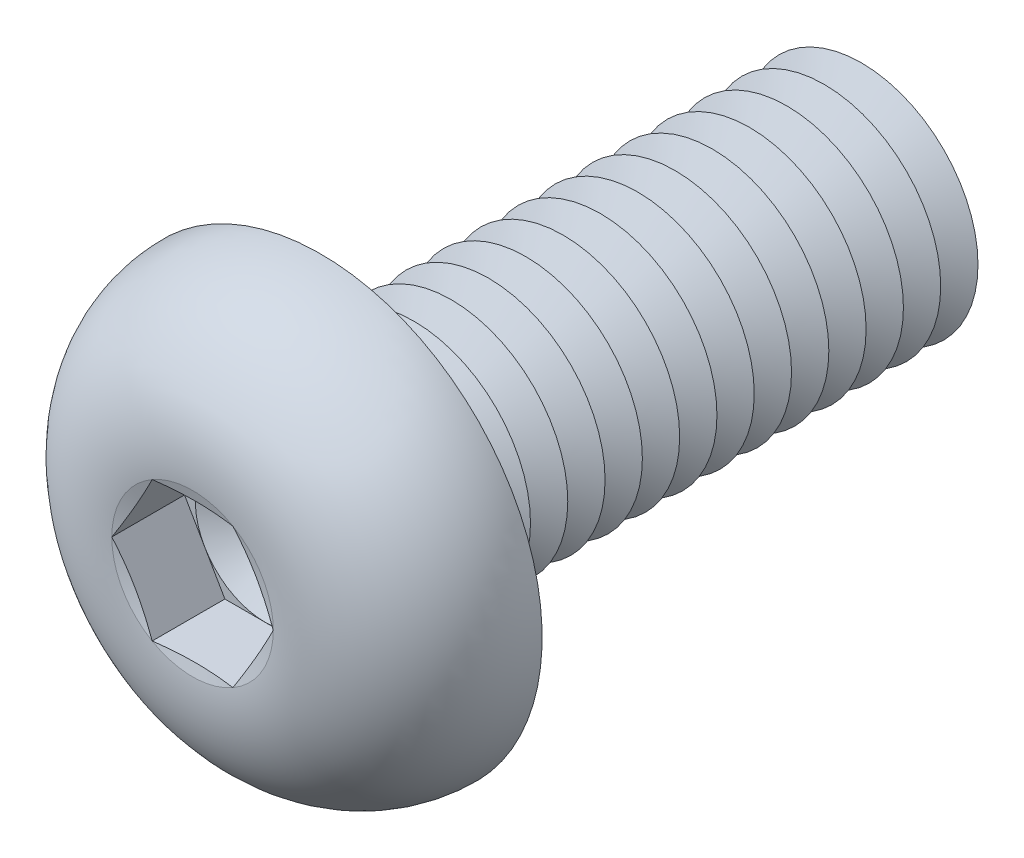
ISO-10303-21;
HEADER;
FILE_DESCRIPTION(('STEP AP214'),'2;1');
FILE_NAME('part.step','',(''),(''),'','','');
FILE_SCHEMA(('AUTOMOTIVE_DESIGN { 1 0 10303 214 1 1 1 1 }'));
ENDSEC;
DATA;
#1=APPLICATION_CONTEXT('core data for automotive mechanical design processes');
#2=APPLICATION_PROTOCOL_DEFINITION('international standard','automotive_design',2000,#1);
#3=PRODUCT_CONTEXT('',#1,'mechanical');
#4=PRODUCT('Part','Part','',(#3));
#5=PRODUCT_RELATED_PRODUCT_CATEGORY('part','',(#4));
#6=PRODUCT_DEFINITION_FORMATION('','',#4);
#7=PRODUCT_DEFINITION_CONTEXT('part definition',#1,'design');
#8=PRODUCT_DEFINITION('design','',#6,#7);
#9=PRODUCT_DEFINITION_SHAPE('','',#8);
#10=(LENGTH_UNIT() NAMED_UNIT(*) SI_UNIT(.MILLI.,.METRE.));
#11=(NAMED_UNIT(*) PLANE_ANGLE_UNIT() SI_UNIT($,.RADIAN.));
#12=(NAMED_UNIT(*) SI_UNIT($,.STERADIAN.) SOLID_ANGLE_UNIT());
#13=UNCERTAINTY_MEASURE_WITH_UNIT(LENGTH_MEASURE(1.E-05),#10,'distance_accuracy_value','');
#14=(GEOMETRIC_REPRESENTATION_CONTEXT(3) GLOBAL_UNCERTAINTY_ASSIGNED_CONTEXT((#13)) GLOBAL_UNIT_ASSIGNED_CONTEXT((#10,
#11,#12)) REPRESENTATION_CONTEXT('',''));
#15=CARTESIAN_POINT('',(0.,0.,0.));
#16=DIRECTION('',(0.,0.,1.));
#17=DIRECTION('',(1.,0.,0.));
#18=AXIS2_PLACEMENT_3D('',#15,#16,#17);
#19=CARTESIAN_POINT('',(0.,0.,1.19));
#20=DIRECTION('',(0.,0.,1.));
#21=DIRECTION('',(1.,0.,0.));
#22=AXIS2_PLACEMENT_3D('',#19,#20,#21);
#23=PLANE('',#22);
#24=CARTESIAN_POINT('',(0.,0.,1.19));
#25=DIRECTION('',(0.,0.,1.));
#26=DIRECTION('',(1.,0.,0.));
#27=AXIS2_PLACEMENT_3D('',#24,#25,#26);
#28=CIRCLE('',#27,1.49999930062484);
#29=CARTESIAN_POINT('',(1.2990375,0.749999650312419,1.19));
#30=VERTEX_POINT('',#29);
#31=CARTESIAN_POINT('',(0.,1.49999930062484,1.19));
#32=VERTEX_POINT('',#31);
#33=EDGE_CURVE('E118',#30,#32,#28,.T.);
#34=ORIENTED_EDGE('',*,*,#33,.F.);
#35=DIRECTION('',(-0.5,0.866025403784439,0.));
#36=VECTOR('',#35,1.);
#37=CARTESIAN_POINT('',(1.73205,0.,1.19));
#38=LINE('',#37,#36);
#39=CARTESIAN_POINT('',(0.866025,1.49999930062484,1.19));
#40=VERTEX_POINT('',#39);
#41=EDGE_CURVE('E125',#30,#40,#38,.T.);
#42=ORIENTED_EDGE('',*,*,#41,.T.);
#43=DIRECTION('',(-1.,0.,0.));
#44=VECTOR('',#43,1.);
#45=CARTESIAN_POINT('',(0.866025,1.49999930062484,1.19));
#46=LINE('',#45,#44);
#47=EDGE_CURVE('E136',#40,#32,#46,.T.);
#48=ORIENTED_EDGE('',*,*,#47,.T.);
#49=EDGE_LOOP('',(#34,#42,#48));
#50=FACE_BOUND('',#49,.T.);
#51=ADVANCED_FACE('F39',(#50),#23,.T.);
#52=CARTESIAN_POINT('',(0.,0.,1.19));
#53=DIRECTION('',(0.,0.,1.));
#54=DIRECTION('',(1.,0.,0.));
#55=AXIS2_PLACEMENT_3D('',#52,#53,#54);
#56=CIRCLE('',#55,1.49999930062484);
#57=CARTESIAN_POINT('',(-1.2990375,0.749999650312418,1.19));
#58=VERTEX_POINT('',#57);
#59=EDGE_CURVE('E11',#32,#58,#56,.T.);
#60=ORIENTED_EDGE('',*,*,#59,.F.);
#61=CARTESIAN_POINT('',(-0.866025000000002,1.49999930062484,1.19));
#62=VERTEX_POINT('',#61);
#63=EDGE_CURVE('E131',#32,#62,#46,.T.);
#64=ORIENTED_EDGE('',*,*,#63,.T.);
#65=DIRECTION('',(-0.5,-0.866025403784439,0.));
#66=VECTOR('',#65,1.);
#67=CARTESIAN_POINT('',(-0.866025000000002,1.49999930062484,1.19));
#68=LINE('',#67,#66);
#69=EDGE_CURVE('E134',#62,#58,#68,.T.);
#70=ORIENTED_EDGE('',*,*,#69,.T.);
#71=EDGE_LOOP('',(#60,#64,#70));
#72=FACE_BOUND('',#71,.T.);
#73=ADVANCED_FACE('F130',(#72),#23,.T.);
#74=CARTESIAN_POINT('',(-1.2990375,-0.749999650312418,1.19));
#75=VERTEX_POINT('',#74);
#76=EDGE_CURVE('E49',#58,#75,#56,.T.);
#77=ORIENTED_EDGE('',*,*,#76,.F.);
#78=CARTESIAN_POINT('',(-1.73205,0.,1.19));
#79=VERTEX_POINT('',#78);
#80=EDGE_CURVE('E143',#58,#79,#68,.T.);
#81=ORIENTED_EDGE('',*,*,#80,.T.);
#82=DIRECTION('',(0.5,-0.866025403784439,0.));
#83=VECTOR('',#82,1.);
#84=CARTESIAN_POINT('',(-1.73205,0.,1.19));
#85=LINE('',#84,#83);
#86=EDGE_CURVE('E152',#79,#75,#85,.T.);
#87=ORIENTED_EDGE('',*,*,#86,.T.);
#88=EDGE_LOOP('',(#77,#81,#87));
#89=FACE_BOUND('',#88,.T.);
#90=ADVANCED_FACE('F388',(#89),#23,.T.);
#91=CARTESIAN_POINT('',(0.,-1.49999930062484,1.19));
#92=VERTEX_POINT('',#91);
#93=EDGE_CURVE('E372',#75,#92,#56,.T.);
#94=ORIENTED_EDGE('',*,*,#93,.F.);
#95=CARTESIAN_POINT('',(-0.866025,-1.49999930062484,1.19));
#96=VERTEX_POINT('',#95);
#97=EDGE_CURVE('E151',#75,#96,#85,.T.);
#98=ORIENTED_EDGE('',*,*,#97,.T.);
#99=DIRECTION('',(1.,0.,0.));
#100=VECTOR('',#99,1.);
#101=CARTESIAN_POINT('',(-0.866025,-1.49999930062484,1.19));
#102=LINE('',#101,#100);
#103=EDGE_CURVE('E157',#96,#92,#102,.T.);
#104=ORIENTED_EDGE('',*,*,#103,.T.);
#105=EDGE_LOOP('',(#94,#98,#104));
#106=FACE_BOUND('',#105,.T.);
#107=ADVANCED_FACE('F381',(#106),#23,.T.);
#108=CARTESIAN_POINT('',(1.2990375,-0.749999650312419,1.19));
#109=VERTEX_POINT('',#108);
#110=EDGE_CURVE('E56',#92,#109,#56,.T.);
#111=ORIENTED_EDGE('',*,*,#110,.F.);
#112=CARTESIAN_POINT('',(0.866025,-1.49999930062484,1.19));
#113=VERTEX_POINT('',#112);
#114=EDGE_CURVE('E156',#92,#113,#102,.T.);
#115=ORIENTED_EDGE('',*,*,#114,.T.);
#116=DIRECTION('',(0.5,0.866025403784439,0.));
#117=VECTOR('',#116,1.);
#118=CARTESIAN_POINT('',(0.866025,-1.49999930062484,1.19));
#119=LINE('',#118,#117);
#120=EDGE_CURVE('E162',#113,#109,#119,.T.);
#121=ORIENTED_EDGE('',*,*,#120,.T.);
#122=EDGE_LOOP('',(#111,#115,#121));
#123=FACE_BOUND('',#122,.T.);
#124=ADVANCED_FACE('F428',(#123),#23,.T.);
#125=CARTESIAN_POINT('',(0.,0.,2.75));
#126=DIRECTION('',(0.,0.,1.));
#127=DIRECTION('',(1.,0.,0.));
#128=AXIS2_PLACEMENT_3D('',#125,#126,#127);
#129=CONICAL_SURFACE('',#128,1.73205,1.30899693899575);
#130=CARTESIAN_POINT('',(1.73216547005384,-0.000200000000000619,2.75003094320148));
#131=CARTESIAN_POINT('',(1.69619207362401,0.0621077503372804,2.74038633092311));
#132=CARTESIAN_POINT('',(1.66015343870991,0.124528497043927,2.73163050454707));
#133=CARTESIAN_POINT('',(1.58794885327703,0.249590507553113,2.71624720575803));
#134=CARTESIAN_POINT('',(1.5517828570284,0.312231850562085,2.70962059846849));
#135=CARTESIAN_POINT('',(1.47954289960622,0.437355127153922,2.69888271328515));
#136=CARTESIAN_POINT('',(1.4434694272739,0.499836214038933,2.69475862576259));
#137=CARTESIAN_POINT('',(1.37127646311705,0.624878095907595,2.68922863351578));
#138=CARTESIAN_POINT('',(1.33515698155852,0.687438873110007,2.68782220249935));
#139=CARTESIAN_POINT('',(1.26291801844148,0.812560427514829,2.68782220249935));
#140=CARTESIAN_POINT('',(1.22679853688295,0.87512120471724,2.68922863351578));
#141=CARTESIAN_POINT('',(1.1546055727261,1.0001630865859,2.69475862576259));
#142=CARTESIAN_POINT('',(1.11853210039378,1.06264417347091,2.69888271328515));
#143=CARTESIAN_POINT('',(1.0462921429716,1.18776745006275,2.70962059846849));
#144=CARTESIAN_POINT('',(1.01012614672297,1.25040879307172,2.71624720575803));
#145=CARTESIAN_POINT('',(0.937921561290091,1.37547080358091,2.73163050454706));
#146=CARTESIAN_POINT('',(0.901882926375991,1.43789155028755,2.74038633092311));
#147=CARTESIAN_POINT('',(0.865909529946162,1.50019930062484,2.75003094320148));
#148=B_SPLINE_CURVE_WITH_KNOTS('',3,(#130,#131,#132,#133,#134,#135,#136,#137,#138,#139,#140,
#141,#142,#143,#144,#145,#146,#147),.UNSPECIFIED.,.F.,.F.,(4,2,2,2,2,2,2,2,4),(0.,
0.217782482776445,0.435653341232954,0.652399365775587,0.869103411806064,1.08580745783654,
1.30255348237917,1.52042434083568,1.73820682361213),.UNSPECIFIED.);
#149=CARTESIAN_POINT('',(1.73205,0.,2.75));
#150=VERTEX_POINT('',#149);
#151=CARTESIAN_POINT('',(0.866025,1.49999930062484,2.75));
#152=VERTEX_POINT('',#151);
#153=EDGE_CURVE('E221',#150,#152,#148,.T.);
#154=ORIENTED_EDGE('',*,*,#153,.F.);
#155=CARTESIAN_POINT('',(0.,0.,2.75));
#156=DIRECTION('',(0.,0.,-1.));
#157=DIRECTION('',(-1.,0.,0.));
#158=AXIS2_PLACEMENT_3D('',#155,#156,#157);
#159=CIRCLE('',#158,1.73205);
#160=EDGE_CURVE('E418',#152,#150,#159,.T.);
#161=ORIENTED_EDGE('',*,*,#160,.F.);
#162=EDGE_LOOP('',(#154,#161));
#163=FACE_BOUND('',#162,.T.);
#164=ADVANCED_FACE('F445',(#163),#129,.F.);
#165=CARTESIAN_POINT('',(0.865909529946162,-1.50019930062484,2.75003094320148));
#166=CARTESIAN_POINT('',(0.901882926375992,-1.43789155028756,2.74038633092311));
#167=CARTESIAN_POINT('',(0.937921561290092,-1.37547080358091,2.73163050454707));
#168=CARTESIAN_POINT('',(1.01012614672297,-1.25040879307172,2.71624720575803));
#169=CARTESIAN_POINT('',(1.0462921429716,-1.18776745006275,2.70962059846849));
#170=CARTESIAN_POINT('',(1.11853210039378,-1.06264417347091,2.69888271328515));
#171=CARTESIAN_POINT('',(1.1546055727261,-1.0001630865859,2.69475862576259));
#172=CARTESIAN_POINT('',(1.22679853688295,-0.875121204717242,2.68922863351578));
#173=CARTESIAN_POINT('',(1.26291801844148,-0.81256042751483,2.68782220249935));
#174=CARTESIAN_POINT('',(1.33515698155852,-0.687438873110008,2.68782220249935));
#175=CARTESIAN_POINT('',(1.37127646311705,-0.624878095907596,2.68922863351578));
#176=CARTESIAN_POINT('',(1.4434694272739,-0.499836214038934,2.69475862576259));
#177=CARTESIAN_POINT('',(1.47954289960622,-0.437355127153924,2.69888271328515));
#178=CARTESIAN_POINT('',(1.5517828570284,-0.312231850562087,2.70962059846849));
#179=CARTESIAN_POINT('',(1.58794885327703,-0.249590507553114,2.71624720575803));
#180=CARTESIAN_POINT('',(1.66015343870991,-0.124528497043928,2.73163050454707));
#181=CARTESIAN_POINT('',(1.69619207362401,-0.0621077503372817,2.74038633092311));
#182=CARTESIAN_POINT('',(1.73216547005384,0.000199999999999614,2.75003094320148));
#183=B_SPLINE_CURVE_WITH_KNOTS('',3,(#165,#166,#167,#168,#169,#170,#171,#172,#173,#174,#175,
#176,#177,#178,#179,#180,#181,#182),.UNSPECIFIED.,.F.,.F.,(4,2,2,2,2,2,2,2,4),(0.,
0.217782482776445,0.435653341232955,0.652399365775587,0.869103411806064,1.08580745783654,
1.30255348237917,1.52042434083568,1.73820682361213),.UNSPECIFIED.);
#184=CARTESIAN_POINT('',(0.866025,-1.49999930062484,2.75));
#185=VERTEX_POINT('',#184);
#186=EDGE_CURVE('E230',#185,#150,#183,.T.);
#187=ORIENTED_EDGE('',*,*,#186,.F.);
#188=EDGE_CURVE('E420',#150,#185,#159,.T.);
#189=ORIENTED_EDGE('',*,*,#188,.F.);
#190=EDGE_LOOP('',(#187,#189));
#191=FACE_BOUND('',#190,.T.);
#192=ADVANCED_FACE('F447',(#191),#129,.F.);
#193=CARTESIAN_POINT('',(-2.61375031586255,-1.49999930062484,3.09338600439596));
#194=CARTESIAN_POINT('',(-2.48719895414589,-1.49999930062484,3.06401688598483));
#195=CARTESIAN_POINT('',(-2.36054180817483,-1.49999930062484,3.03507426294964));
#196=CARTESIAN_POINT('',(-2.10688190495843,-1.49999930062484,2.97862489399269));
#197=CARTESIAN_POINT('',(-1.97987908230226,-1.49999930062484,2.95111844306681));
#198=CARTESIAN_POINT('',(-1.72425281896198,-1.49999930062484,2.89788845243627));
#199=CARTESIAN_POINT('',(-1.59562534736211,-1.49999930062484,2.87218404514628));
#200=CARTESIAN_POINT('',(-1.33776732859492,-1.49999930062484,2.82387586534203));
#201=CARTESIAN_POINT('',(-1.20853672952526,-1.49999930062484,2.80127236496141));
#202=CARTESIAN_POINT('',(-0.952831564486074,-1.49999930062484,2.76126658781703));
#203=CARTESIAN_POINT('',(-0.826376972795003,-1.49999930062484,2.74374018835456));
#204=CARTESIAN_POINT('',(-0.572755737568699,-1.49999930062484,2.71502809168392));
#205=CARTESIAN_POINT('',(-0.445589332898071,-1.49999930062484,2.70384038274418));
#206=CARTESIAN_POINT('',(-0.191333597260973,-1.49999930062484,2.68972083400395));
#207=CARTESIAN_POINT('',(-0.0642464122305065,-1.49999930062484,2.68675270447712));
#208=CARTESIAN_POINT('',(0.189835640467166,-1.49999930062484,2.68959577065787));
#209=CARTESIAN_POINT('',(0.31683049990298,-1.49999930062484,2.69540767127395));
#210=CARTESIAN_POINT('',(0.53418249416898,-1.49999930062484,2.71190493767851));
#211=CARTESIAN_POINT('',(0.624691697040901,-1.49999930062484,2.72073513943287));
#212=CARTESIAN_POINT('',(0.805336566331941,-1.49999930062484,2.74156379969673));
#213=CARTESIAN_POINT('',(0.895472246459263,-1.49999930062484,2.75356214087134));
#214=CARTESIAN_POINT('',(1.0756572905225,-1.49999930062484,2.78006977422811));
#215=CARTESIAN_POINT('',(1.16570548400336,-1.49999930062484,2.7945868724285));
#216=CARTESIAN_POINT('',(1.3454787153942,-1.49999930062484,2.82550612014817));
#217=CARTESIAN_POINT('',(1.43520373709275,-1.49999930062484,2.8419083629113));
#218=CARTESIAN_POINT('',(1.61622412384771,-1.49999930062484,2.87648604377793));
#219=CARTESIAN_POINT('',(1.70751379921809,-1.49999930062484,2.89469103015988));
#220=CARTESIAN_POINT('',(1.88986344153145,-1.49999930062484,2.93221618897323));
#221=CARTESIAN_POINT('',(1.98092340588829,-1.49999930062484,2.95153637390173));
#222=CARTESIAN_POINT('',(2.16236354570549,-1.49999930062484,2.99091506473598));
#223=CARTESIAN_POINT('',(2.25274472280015,-1.49999930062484,3.01096897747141));
#224=CARTESIAN_POINT('',(2.43335289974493,-1.49999930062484,3.05173139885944));
#225=CARTESIAN_POINT('',(2.52357990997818,-1.49999930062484,3.07243986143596));
#226=CARTESIAN_POINT('',(2.61375031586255,-1.49999930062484,3.09338600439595));
#227=B_SPLINE_CURVE_WITH_KNOTS('',3,(#193,#194,#195,#196,#197,#198,#199,#200,#201,#202,#203,
#204,#205,#206,#207,#208,#209,#210,#211,#212,#213,#214,#215,#216,#217,#218,#219,#220,#221,#222,
#223,#224,#225,#226),.UNSPECIFIED.,.F.,.F.,(4,2,2,2,2,2,2,2,2,2,2,2,2,2,2,2,4),(0.,
0.389753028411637,0.779585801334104,1.17307326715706,1.5665952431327,1.94947555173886,
2.33223427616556,2.71330039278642,3.09439710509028,3.36715350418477,3.63989980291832,
3.91350699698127,4.18712773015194,4.4663802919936,4.74563598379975,5.02337106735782,
5.3010866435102),.UNSPECIFIED.);
#228=CARTESIAN_POINT('',(-0.866025,-1.49999930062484,2.75));
#229=VERTEX_POINT('',#228);
#230=EDGE_CURVE('E400',#229,#185,#227,.T.);
#231=ORIENTED_EDGE('',*,*,#230,.F.);
#232=EDGE_CURVE('E408',#185,#229,#159,.T.);
#233=ORIENTED_EDGE('',*,*,#232,.F.);
#234=EDGE_LOOP('',(#231,#233));
#235=FACE_BOUND('',#234,.T.);
#236=ADVANCED_FACE('F449',(#235),#129,.F.);
#237=CARTESIAN_POINT('',(-1.73216547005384,0.000200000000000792,2.75003094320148));
#238=CARTESIAN_POINT('',(-1.69619207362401,-0.0621077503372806,2.74038633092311));
#239=CARTESIAN_POINT('',(-1.66015343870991,-0.124528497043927,2.73163050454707));
#240=CARTESIAN_POINT('',(-1.58794885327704,-0.249590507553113,2.71624720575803));
#241=CARTESIAN_POINT('',(-1.55178285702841,-0.312231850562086,2.70962059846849));
#242=CARTESIAN_POINT('',(-1.47954289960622,-0.437355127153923,2.69888271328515));
#243=CARTESIAN_POINT('',(-1.4434694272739,-0.499836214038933,2.69475862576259));
#244=CARTESIAN_POINT('',(-1.37127646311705,-0.624878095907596,2.68922863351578));
#245=CARTESIAN_POINT('',(-1.33515698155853,-0.687438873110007,2.68782220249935));
#246=CARTESIAN_POINT('',(-1.26291801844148,-0.81256042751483,2.68782220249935));
#247=CARTESIAN_POINT('',(-1.22679853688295,-0.875121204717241,2.68922863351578));
#248=CARTESIAN_POINT('',(-1.1546055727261,-1.0001630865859,2.69475862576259));
#249=CARTESIAN_POINT('',(-1.11853210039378,-1.06264417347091,2.69888271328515));
#250=CARTESIAN_POINT('',(-1.0462921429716,-1.18776745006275,2.70962059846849));
#251=CARTESIAN_POINT('',(-1.01012614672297,-1.25040879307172,2.71624720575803));
#252=CARTESIAN_POINT('',(-0.937921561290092,-1.37547080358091,2.73163050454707));
#253=CARTESIAN_POINT('',(-0.901882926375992,-1.43789155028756,2.74038633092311));
#254=CARTESIAN_POINT('',(-0.865909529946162,-1.50019930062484,2.75003094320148));
#255=B_SPLINE_CURVE_WITH_KNOTS('',3,(#237,#238,#239,#240,#241,#242,#243,#244,#245,#246,#247,
#248,#249,#250,#251,#252,#253,#254),.UNSPECIFIED.,.F.,.F.,(4,2,2,2,2,2,2,2,4),(0.,
0.217782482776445,0.435653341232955,0.652399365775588,0.869103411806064,1.08580745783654,
1.30255348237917,1.52042434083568,1.73820682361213),.UNSPECIFIED.);
#256=CARTESIAN_POINT('',(-1.73205,0.,2.75));
#257=VERTEX_POINT('',#256);
#258=EDGE_CURVE('E393',#257,#229,#255,.T.);
#259=ORIENTED_EDGE('',*,*,#258,.F.);
#260=EDGE_CURVE('E355',#229,#257,#159,.T.);
#261=ORIENTED_EDGE('',*,*,#260,.F.);
#262=EDGE_LOOP('',(#259,#261));
#263=FACE_BOUND('',#262,.T.);
#264=ADVANCED_FACE('F397',(#263),#129,.F.);
#265=CARTESIAN_POINT('',(-0.865909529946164,1.50019930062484,2.75003094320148));
#266=CARTESIAN_POINT('',(-0.901882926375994,1.43789155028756,2.74038633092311));
#267=CARTESIAN_POINT('',(-0.937921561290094,1.37547080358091,2.73163050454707));
#268=CARTESIAN_POINT('',(-1.01012614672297,1.25040879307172,2.71624720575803));
#269=CARTESIAN_POINT('',(-1.0462921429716,1.18776745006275,2.70962059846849));
#270=CARTESIAN_POINT('',(-1.11853210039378,1.06264417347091,2.69888271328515));
#271=CARTESIAN_POINT('',(-1.1546055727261,1.0001630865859,2.69475862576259));
#272=CARTESIAN_POINT('',(-1.22679853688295,0.875121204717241,2.68922863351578));
#273=CARTESIAN_POINT('',(-1.26291801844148,0.81256042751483,2.68782220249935));
#274=CARTESIAN_POINT('',(-1.33515698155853,0.687438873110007,2.68782220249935));
#275=CARTESIAN_POINT('',(-1.37127646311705,0.624878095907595,2.68922863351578));
#276=CARTESIAN_POINT('',(-1.4434694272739,0.499836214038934,2.69475862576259));
#277=CARTESIAN_POINT('',(-1.47954289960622,0.437355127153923,2.69888271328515));
#278=CARTESIAN_POINT('',(-1.55178285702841,0.312231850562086,2.70962059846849));
#279=CARTESIAN_POINT('',(-1.58794885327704,0.249590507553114,2.71624720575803));
#280=CARTESIAN_POINT('',(-1.66015343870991,0.124528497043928,2.73163050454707));
#281=CARTESIAN_POINT('',(-1.69619207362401,0.0621077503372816,2.74038633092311));
#282=CARTESIAN_POINT('',(-1.73216547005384,-0.000199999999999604,2.75003094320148));
#283=B_SPLINE_CURVE_WITH_KNOTS('',3,(#265,#266,#267,#268,#269,#270,#271,#272,#273,#274,#275,
#276,#277,#278,#279,#280,#281,#282),.UNSPECIFIED.,.F.,.F.,(4,2,2,2,2,2,2,2,4),(0.,
0.217782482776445,0.435653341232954,0.652399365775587,0.869103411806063,1.08580745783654,
1.30255348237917,1.52042434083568,1.73820682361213),.UNSPECIFIED.);
#284=CARTESIAN_POINT('',(-0.866025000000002,1.49999930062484,2.75));
#285=VERTEX_POINT('',#284);
#286=EDGE_CURVE('E195',#285,#257,#283,.T.);
#287=ORIENTED_EDGE('',*,*,#286,.F.);
#288=EDGE_CURVE('E356',#257,#285,#159,.T.);
#289=ORIENTED_EDGE('',*,*,#288,.F.);
#290=EDGE_LOOP('',(#287,#289));
#291=FACE_BOUND('',#290,.T.);
#292=ADVANCED_FACE('F411',(#291),#129,.F.);
#293=CARTESIAN_POINT('',(0.,0.,-9.2));
#294=DIRECTION('',(0.,0.,1.));
#295=DIRECTION('',(1.,0.,0.));
#296=AXIS2_PLACEMENT_3D('',#293,#294,#295);
#297=CONICAL_SURFACE('',#296,2.5,1.0471975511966);
#298=CARTESIAN_POINT('',(0.,0.,-9.6));
#299=DIRECTION('',(0.,0.,1.));
#300=DIRECTION('',(1.,0.,0.));
#301=AXIS2_PLACEMENT_3D('',#298,#299,#300);
#302=CIRCLE('',#301,1.80717967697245);
#303=CARTESIAN_POINT('',(1.80717967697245,0.,-9.6));
#304=VERTEX_POINT('',#303);
#305=EDGE_CURVE('E328',#304,#304,#302,.T.);
#306=ORIENTED_EDGE('',*,*,#305,.T.);
#307=EDGE_LOOP('',(#306));
#308=FACE_BOUND('',#307,.T.);
#309=CARTESIAN_POINT('',(0.,0.,-9.2));
#310=DIRECTION('',(0.,0.,1.));
#311=DIRECTION('',(1.,0.,0.));
#312=AXIS2_PLACEMENT_3D('',#309,#310,#311);
#313=CIRCLE('',#312,2.5);
#314=CARTESIAN_POINT('',(2.5,0.,-9.2));
#315=VERTEX_POINT('',#314);
#316=EDGE_CURVE('E324',#315,#315,#313,.T.);
#317=ORIENTED_EDGE('',*,*,#316,.F.);
#318=EDGE_LOOP('',(#317));
#319=FACE_BOUND('',#318,.T.);
#320=ADVANCED_FACE('F510',(#308,#319),#297,.T.);
#321=CARTESIAN_POINT('',(0.,0.,-9.6));
#322=DIRECTION('',(0.,0.,-1.));
#323=DIRECTION('',(-1.,0.,0.));
#324=AXIS2_PLACEMENT_3D('',#321,#322,#323);
#325=CONICAL_SURFACE('',#324,1.80717967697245,1.0471975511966);
#326=CARTESIAN_POINT('',(0.,0.,-10.));
#327=DIRECTION('',(0.,0.,1.));
#328=DIRECTION('',(1.,0.,0.));
#329=AXIS2_PLACEMENT_3D('',#326,#327,#328);
#330=CIRCLE('',#329,2.5);
#331=CARTESIAN_POINT('',(2.5,0.,-10.));
#332=VERTEX_POINT('',#331);
#333=EDGE_CURVE('E332',#332,#332,#330,.T.);
#334=ORIENTED_EDGE('',*,*,#333,.T.);
#335=EDGE_LOOP('',(#334));
#336=FACE_BOUND('',#335,.T.);
#337=ORIENTED_EDGE('',*,*,#305,.F.);
#338=EDGE_LOOP('',(#337));
#339=FACE_BOUND('',#338,.T.);
#340=ADVANCED_FACE('F797',(#336,#339),#325,.T.);
#341=CARTESIAN_POINT('',(0.,2.50000000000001,-12.));
#342=DIRECTION('',(0.,0.,-1.));
#343=DIRECTION('',(-1.,0.,0.));
#344=AXIS2_PLACEMENT_3D('',#341,#342,#343);
#345=PLANE('',#344);
#346=CARTESIAN_POINT('',(0.,0.,-12.));
#347=DIRECTION('',(0.,0.,1.));
#348=DIRECTION('',(1.,0.,0.));
#349=AXIS2_PLACEMENT_3D('',#346,#347,#348);
#350=CIRCLE('',#349,1.80717967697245);
#351=CARTESIAN_POINT('',(1.80717967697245,0.,-12.));
#352=VERTEX_POINT('',#351);
#353=EDGE_CURVE('E351',#352,#352,#350,.T.);
#354=ORIENTED_EDGE('',*,*,#353,.F.);
#355=EDGE_LOOP('',(#354));
#356=FACE_BOUND('',#355,.T.);
#357=ADVANCED_FACE('F802',(#356),#345,.T.);
#358=CARTESIAN_POINT('',(0.,0.,-11.6));
#359=DIRECTION('',(0.,0.,1.));
#360=DIRECTION('',(1.,0.,0.));
#361=AXIS2_PLACEMENT_3D('',#358,#359,#360);
#362=CONICAL_SURFACE('',#361,2.5,1.0471975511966);
#363=ORIENTED_EDGE('',*,*,#353,.T.);
#364=EDGE_LOOP('',(#363));
#365=FACE_BOUND('',#364,.T.);
#366=CARTESIAN_POINT('',(0.,0.,-11.6));
#367=DIRECTION('',(0.,0.,1.));
#368=DIRECTION('',(1.,0.,0.));
#369=AXIS2_PLACEMENT_3D('',#366,#367,#368);
#370=CIRCLE('',#369,2.5);
#371=CARTESIAN_POINT('',(2.5,0.,-11.6));
#372=VERTEX_POINT('',#371);
#373=EDGE_CURVE('E347',#372,#372,#370,.T.);
#374=ORIENTED_EDGE('',*,*,#373,.F.);
#375=EDGE_LOOP('',(#374));
#376=FACE_BOUND('',#375,.T.);
#377=ADVANCED_FACE('F790',(#365,#376),#362,.T.);
#378=CARTESIAN_POINT('',(0.,0.,-11.2));
#379=DIRECTION('',(0.,0.,-1.));
#380=DIRECTION('',(-1.,0.,0.));
#381=AXIS2_PLACEMENT_3D('',#378,#379,#380);
#382=CONICAL_SURFACE('',#381,1.80717967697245,1.0471975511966);
#383=ORIENTED_EDGE('',*,*,#373,.T.);
#384=EDGE_LOOP('',(#383));
#385=FACE_BOUND('',#384,.T.);
#386=CARTESIAN_POINT('',(0.,0.,-11.2));
#387=DIRECTION('',(0.,0.,1.));
#388=DIRECTION('',(1.,0.,0.));
#389=AXIS2_PLACEMENT_3D('',#386,#387,#388);
#390=CIRCLE('',#389,1.80717967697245);
#391=CARTESIAN_POINT('',(1.80717967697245,0.,-11.2));
#392=VERTEX_POINT('',#391);
#393=EDGE_CURVE('E343',#392,#392,#390,.T.);
#394=ORIENTED_EDGE('',*,*,#393,.F.);
#395=EDGE_LOOP('',(#394));
#396=FACE_BOUND('',#395,.T.);
#397=ADVANCED_FACE('F780',(#385,#396),#382,.T.);
#398=CARTESIAN_POINT('',(0.,0.,-10.8));
#399=DIRECTION('',(0.,0.,1.));
#400=DIRECTION('',(1.,0.,0.));
#401=AXIS2_PLACEMENT_3D('',#398,#399,#400);
#402=CONICAL_SURFACE('',#401,2.5,1.0471975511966);
#403=ORIENTED_EDGE('',*,*,#393,.T.);
#404=EDGE_LOOP('',(#403));
#405=FACE_BOUND('',#404,.T.);
#406=CARTESIAN_POINT('',(0.,0.,-10.8));
#407=DIRECTION('',(0.,0.,1.));
#408=DIRECTION('',(1.,0.,0.));
#409=AXIS2_PLACEMENT_3D('',#406,#407,#408);
#410=CIRCLE('',#409,2.5);
#411=CARTESIAN_POINT('',(2.5,0.,-10.8));
#412=VERTEX_POINT('',#411);
#413=EDGE_CURVE('E339',#412,#412,#410,.T.);
#414=ORIENTED_EDGE('',*,*,#413,.F.);
#415=EDGE_LOOP('',(#414));
#416=FACE_BOUND('',#415,.T.);
#417=ADVANCED_FACE('F770',(#405,#416),#402,.T.);
#418=CARTESIAN_POINT('',(0.,0.,-10.4));
#419=DIRECTION('',(0.,0.,-1.));
#420=DIRECTION('',(-1.,0.,0.));
#421=AXIS2_PLACEMENT_3D('',#418,#419,#420);
#422=CONICAL_SURFACE('',#421,1.80717967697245,1.0471975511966);
#423=ORIENTED_EDGE('',*,*,#413,.T.);
#424=EDGE_LOOP('',(#423));
#425=FACE_BOUND('',#424,.T.);
#426=CARTESIAN_POINT('',(0.,0.,-10.4));
#427=DIRECTION('',(0.,0.,1.));
#428=DIRECTION('',(1.,0.,0.));
#429=AXIS2_PLACEMENT_3D('',#426,#427,#428);
#430=CIRCLE('',#429,1.80717967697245);
#431=CARTESIAN_POINT('',(1.80717967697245,0.,-10.4));
#432=VERTEX_POINT('',#431);
#433=EDGE_CURVE('E336',#432,#432,#430,.T.);
#434=ORIENTED_EDGE('',*,*,#433,.F.);
#435=EDGE_LOOP('',(#434));
#436=FACE_BOUND('',#435,.T.);
#437=ADVANCED_FACE('F760',(#425,#436),#422,.T.);
#438=CARTESIAN_POINT('',(0.,0.,-10.));
#439=DIRECTION('',(0.,0.,1.));
#440=DIRECTION('',(1.,0.,0.));
#441=AXIS2_PLACEMENT_3D('',#438,#439,#440);
#442=CONICAL_SURFACE('',#441,2.5,1.0471975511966);
#443=ORIENTED_EDGE('',*,*,#433,.T.);
#444=EDGE_LOOP('',(#443));
#445=FACE_BOUND('',#444,.T.);
#446=ORIENTED_EDGE('',*,*,#333,.F.);
#447=EDGE_LOOP('',(#446));
#448=FACE_BOUND('',#447,.T.);
#449=ADVANCED_FACE('F750',(#445,#448),#442,.T.);
#450=CARTESIAN_POINT('',(0.,0.,-8.4));
#451=DIRECTION('',(0.,0.,1.));
#452=DIRECTION('',(1.,0.,0.));
#453=AXIS2_PLACEMENT_3D('',#450,#451,#452);
#454=CONICAL_SURFACE('',#453,2.5,1.0471975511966);
#455=CARTESIAN_POINT('',(0.,0.,-8.8));
#456=DIRECTION('',(0.,0.,1.));
#457=DIRECTION('',(1.,0.,0.));
#458=AXIS2_PLACEMENT_3D('',#455,#456,#457);
#459=CIRCLE('',#458,1.80717967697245);
#460=CARTESIAN_POINT('',(1.80717967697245,0.,-8.8));
#461=VERTEX_POINT('',#460);
#462=EDGE_CURVE('E320',#461,#461,#459,.T.);
#463=ORIENTED_EDGE('',*,*,#462,.T.);
#464=EDGE_LOOP('',(#463));
#465=FACE_BOUND('',#464,.T.);
#466=CARTESIAN_POINT('',(0.,0.,-8.4));
#467=DIRECTION('',(0.,0.,1.));
#468=DIRECTION('',(1.,0.,0.));
#469=AXIS2_PLACEMENT_3D('',#466,#467,#468);
#470=CIRCLE('',#469,2.5);
#471=CARTESIAN_POINT('',(2.5,0.,-8.4));
#472=VERTEX_POINT('',#471);
#473=EDGE_CURVE('E316',#472,#472,#470,.T.);
#474=ORIENTED_EDGE('',*,*,#473,.F.);
#475=EDGE_LOOP('',(#474));
#476=FACE_BOUND('',#475,.T.);
#477=ADVANCED_FACE('F740',(#465,#476),#454,.T.);
#478=CARTESIAN_POINT('',(0.,0.,-8.8));
#479=DIRECTION('',(0.,0.,-1.));
#480=DIRECTION('',(-1.,0.,0.));
#481=AXIS2_PLACEMENT_3D('',#478,#479,#480);
#482=CONICAL_SURFACE('',#481,1.80717967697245,1.0471975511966);
#483=ORIENTED_EDGE('',*,*,#316,.T.);
#484=EDGE_LOOP('',(#483));
#485=FACE_BOUND('',#484,.T.);
#486=ORIENTED_EDGE('',*,*,#462,.F.);
#487=EDGE_LOOP('',(#486));
#488=FACE_BOUND('',#487,.T.);
#489=ADVANCED_FACE('F730',(#485,#488),#482,.T.);
#490=CARTESIAN_POINT('',(0.,0.,-7.6));
#491=DIRECTION('',(0.,0.,1.));
#492=DIRECTION('',(1.,0.,0.));
#493=AXIS2_PLACEMENT_3D('',#490,#491,#492);
#494=CONICAL_SURFACE('',#493,2.5,1.0471975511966);
#495=CARTESIAN_POINT('',(0.,0.,-8.));
#496=DIRECTION('',(0.,0.,1.));
#497=DIRECTION('',(1.,0.,0.));
#498=AXIS2_PLACEMENT_3D('',#495,#496,#497);
#499=CIRCLE('',#498,1.80717967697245);
#500=CARTESIAN_POINT('',(1.80717967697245,0.,-8.));
#501=VERTEX_POINT('',#500);
#502=EDGE_CURVE('E312',#501,#501,#499,.T.);
#503=ORIENTED_EDGE('',*,*,#502,.T.);
#504=EDGE_LOOP('',(#503));
#505=FACE_BOUND('',#504,.T.);
#506=CARTESIAN_POINT('',(0.,0.,-7.6));
#507=DIRECTION('',(0.,0.,1.));
#508=DIRECTION('',(1.,0.,0.));
#509=AXIS2_PLACEMENT_3D('',#506,#507,#508);
#510=CIRCLE('',#509,2.5);
#511=CARTESIAN_POINT('',(2.5,0.,-7.6));
#512=VERTEX_POINT('',#511);
#513=EDGE_CURVE('E308',#512,#512,#510,.T.);
#514=ORIENTED_EDGE('',*,*,#513,.F.);
#515=EDGE_LOOP('',(#514));
#516=FACE_BOUND('',#515,.T.);
#517=ADVANCED_FACE('F720',(#505,#516),#494,.T.);
#518=CARTESIAN_POINT('',(0.,0.,-8.));
#519=DIRECTION('',(0.,0.,-1.));
#520=DIRECTION('',(-1.,0.,0.));
#521=AXIS2_PLACEMENT_3D('',#518,#519,#520);
#522=CONICAL_SURFACE('',#521,1.80717967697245,1.0471975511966);
#523=ORIENTED_EDGE('',*,*,#473,.T.);
#524=EDGE_LOOP('',(#523));
#525=FACE_BOUND('',#524,.T.);
#526=ORIENTED_EDGE('',*,*,#502,.F.);
#527=EDGE_LOOP('',(#526));
#528=FACE_BOUND('',#527,.T.);
#529=ADVANCED_FACE('F710',(#525,#528),#522,.T.);
#530=CARTESIAN_POINT('',(0.,0.,-6.8));
#531=DIRECTION('',(0.,0.,1.));
#532=DIRECTION('',(1.,0.,0.));
#533=AXIS2_PLACEMENT_3D('',#530,#531,#532);
#534=CONICAL_SURFACE('',#533,2.5,1.0471975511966);
#535=CARTESIAN_POINT('',(0.,0.,-7.2));
#536=DIRECTION('',(0.,0.,1.));
#537=DIRECTION('',(1.,0.,0.));
#538=AXIS2_PLACEMENT_3D('',#535,#536,#537);
#539=CIRCLE('',#538,1.80717967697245);
#540=CARTESIAN_POINT('',(1.80717967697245,0.,-7.2));
#541=VERTEX_POINT('',#540);
#542=EDGE_CURVE('E304',#541,#541,#539,.T.);
#543=ORIENTED_EDGE('',*,*,#542,.T.);
#544=EDGE_LOOP('',(#543));
#545=FACE_BOUND('',#544,.T.);
#546=CARTESIAN_POINT('',(0.,0.,-6.8));
#547=DIRECTION('',(0.,0.,1.));
#548=DIRECTION('',(1.,0.,0.));
#549=AXIS2_PLACEMENT_3D('',#546,#547,#548);
#550=CIRCLE('',#549,2.5);
#551=CARTESIAN_POINT('',(2.5,0.,-6.8));
#552=VERTEX_POINT('',#551);
#553=EDGE_CURVE('E300',#552,#552,#550,.T.);
#554=ORIENTED_EDGE('',*,*,#553,.F.);
#555=EDGE_LOOP('',(#554));
#556=FACE_BOUND('',#555,.T.);
#557=ADVANCED_FACE('F700',(#545,#556),#534,.T.);
#558=CARTESIAN_POINT('',(0.,0.,-7.2));
#559=DIRECTION('',(0.,0.,-1.));
#560=DIRECTION('',(-1.,0.,0.));
#561=AXIS2_PLACEMENT_3D('',#558,#559,#560);
#562=CONICAL_SURFACE('',#561,1.80717967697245,1.0471975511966);
#563=ORIENTED_EDGE('',*,*,#513,.T.);
#564=EDGE_LOOP('',(#563));
#565=FACE_BOUND('',#564,.T.);
#566=ORIENTED_EDGE('',*,*,#542,.F.);
#567=EDGE_LOOP('',(#566));
#568=FACE_BOUND('',#567,.T.);
#569=ADVANCED_FACE('F690',(#565,#568),#562,.T.);
#570=CARTESIAN_POINT('',(0.,0.,-6.));
#571=DIRECTION('',(0.,0.,1.));
#572=DIRECTION('',(1.,0.,0.));
#573=AXIS2_PLACEMENT_3D('',#570,#571,#572);
#574=CONICAL_SURFACE('',#573,2.5,1.0471975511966);
#575=CARTESIAN_POINT('',(0.,0.,-6.4));
#576=DIRECTION('',(0.,0.,1.));
#577=DIRECTION('',(1.,0.,0.));
#578=AXIS2_PLACEMENT_3D('',#575,#576,#577);
#579=CIRCLE('',#578,1.80717967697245);
#580=CARTESIAN_POINT('',(1.80717967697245,0.,-6.4));
#581=VERTEX_POINT('',#580);
#582=EDGE_CURVE('E296',#581,#581,#579,.T.);
#583=ORIENTED_EDGE('',*,*,#582,.T.);
#584=EDGE_LOOP('',(#583));
#585=FACE_BOUND('',#584,.T.);
#586=CARTESIAN_POINT('',(0.,0.,-6.));
#587=DIRECTION('',(0.,0.,1.));
#588=DIRECTION('',(1.,0.,0.));
#589=AXIS2_PLACEMENT_3D('',#586,#587,#588);
#590=CIRCLE('',#589,2.5);
#591=CARTESIAN_POINT('',(2.5,0.,-6.));
#592=VERTEX_POINT('',#591);
#593=EDGE_CURVE('E292',#592,#592,#590,.T.);
#594=ORIENTED_EDGE('',*,*,#593,.F.);
#595=EDGE_LOOP('',(#594));
#596=FACE_BOUND('',#595,.T.);
#597=ADVANCED_FACE('F680',(#585,#596),#574,.T.);
#598=CARTESIAN_POINT('',(0.,0.,-6.4));
#599=DIRECTION('',(0.,0.,-1.));
#600=DIRECTION('',(-1.,0.,0.));
#601=AXIS2_PLACEMENT_3D('',#598,#599,#600);
#602=CONICAL_SURFACE('',#601,1.80717967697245,1.0471975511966);
#603=ORIENTED_EDGE('',*,*,#553,.T.);
#604=EDGE_LOOP('',(#603));
#605=FACE_BOUND('',#604,.T.);
#606=ORIENTED_EDGE('',*,*,#582,.F.);
#607=EDGE_LOOP('',(#606));
#608=FACE_BOUND('',#607,.T.);
#609=ADVANCED_FACE('F670',(#605,#608),#602,.T.);
#610=CARTESIAN_POINT('',(0.,0.,-5.2));
#611=DIRECTION('',(0.,0.,1.));
#612=DIRECTION('',(1.,0.,0.));
#613=AXIS2_PLACEMENT_3D('',#610,#611,#612);
#614=CONICAL_SURFACE('',#613,2.5,1.0471975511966);
#615=CARTESIAN_POINT('',(0.,0.,-5.6));
#616=DIRECTION('',(0.,0.,1.));
#617=DIRECTION('',(1.,0.,0.));
#618=AXIS2_PLACEMENT_3D('',#615,#616,#617);
#619=CIRCLE('',#618,1.80717967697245);
#620=CARTESIAN_POINT('',(1.80717967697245,0.,-5.6));
#621=VERTEX_POINT('',#620);
#622=EDGE_CURVE('E288',#621,#621,#619,.T.);
#623=ORIENTED_EDGE('',*,*,#622,.T.);
#624=EDGE_LOOP('',(#623));
#625=FACE_BOUND('',#624,.T.);
#626=CARTESIAN_POINT('',(0.,0.,-5.2));
#627=DIRECTION('',(0.,0.,1.));
#628=DIRECTION('',(1.,0.,0.));
#629=AXIS2_PLACEMENT_3D('',#626,#627,#628);
#630=CIRCLE('',#629,2.5);
#631=CARTESIAN_POINT('',(2.5,0.,-5.2));
#632=VERTEX_POINT('',#631);
#633=EDGE_CURVE('E284',#632,#632,#630,.T.);
#634=ORIENTED_EDGE('',*,*,#633,.F.);
#635=EDGE_LOOP('',(#634));
#636=FACE_BOUND('',#635,.T.);
#637=ADVANCED_FACE('F660',(#625,#636),#614,.T.);
#638=CARTESIAN_POINT('',(0.,0.,-5.6));
#639=DIRECTION('',(0.,0.,-1.));
#640=DIRECTION('',(-1.,0.,0.));
#641=AXIS2_PLACEMENT_3D('',#638,#639,#640);
#642=CONICAL_SURFACE('',#641,1.80717967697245,1.0471975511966);
#643=ORIENTED_EDGE('',*,*,#593,.T.);
#644=EDGE_LOOP('',(#643));
#645=FACE_BOUND('',#644,.T.);
#646=ORIENTED_EDGE('',*,*,#622,.F.);
#647=EDGE_LOOP('',(#646));
#648=FACE_BOUND('',#647,.T.);
#649=ADVANCED_FACE('F650',(#645,#648),#642,.T.);
#650=CARTESIAN_POINT('',(0.,0.,-4.4));
#651=DIRECTION('',(0.,0.,1.));
#652=DIRECTION('',(1.,0.,0.));
#653=AXIS2_PLACEMENT_3D('',#650,#651,#652);
#654=CONICAL_SURFACE('',#653,2.5,1.0471975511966);
#655=CARTESIAN_POINT('',(0.,0.,-4.8));
#656=DIRECTION('',(0.,0.,1.));
#657=DIRECTION('',(1.,0.,0.));
#658=AXIS2_PLACEMENT_3D('',#655,#656,#657);
#659=CIRCLE('',#658,1.80717967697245);
#660=CARTESIAN_POINT('',(1.80717967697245,0.,-4.8));
#661=VERTEX_POINT('',#660);
#662=EDGE_CURVE('E280',#661,#661,#659,.T.);
#663=ORIENTED_EDGE('',*,*,#662,.T.);
#664=EDGE_LOOP('',(#663));
#665=FACE_BOUND('',#664,.T.);
#666=CARTESIAN_POINT('',(0.,0.,-4.4));
#667=DIRECTION('',(0.,0.,1.));
#668=DIRECTION('',(1.,0.,0.));
#669=AXIS2_PLACEMENT_3D('',#666,#667,#668);
#670=CIRCLE('',#669,2.5);
#671=CARTESIAN_POINT('',(2.5,0.,-4.4));
#672=VERTEX_POINT('',#671);
#673=EDGE_CURVE('E276',#672,#672,#670,.T.);
#674=ORIENTED_EDGE('',*,*,#673,.F.);
#675=EDGE_LOOP('',(#674));
#676=FACE_BOUND('',#675,.T.);
#677=ADVANCED_FACE('F640',(#665,#676),#654,.T.);
#678=CARTESIAN_POINT('',(0.,0.,-4.8));
#679=DIRECTION('',(0.,0.,-1.));
#680=DIRECTION('',(-1.,0.,0.));
#681=AXIS2_PLACEMENT_3D('',#678,#679,#680);
#682=CONICAL_SURFACE('',#681,1.80717967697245,1.0471975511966);
#683=ORIENTED_EDGE('',*,*,#633,.T.);
#684=EDGE_LOOP('',(#683));
#685=FACE_BOUND('',#684,.T.);
#686=ORIENTED_EDGE('',*,*,#662,.F.);
#687=EDGE_LOOP('',(#686));
#688=FACE_BOUND('',#687,.T.);
#689=ADVANCED_FACE('F630',(#685,#688),#682,.T.);
#690=CARTESIAN_POINT('',(0.,0.,-3.6));
#691=DIRECTION('',(0.,0.,1.));
#692=DIRECTION('',(1.,0.,0.));
#693=AXIS2_PLACEMENT_3D('',#690,#691,#692);
#694=CONICAL_SURFACE('',#693,2.5,1.0471975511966);
#695=CARTESIAN_POINT('',(0.,0.,-4.));
#696=DIRECTION('',(0.,0.,1.));
#697=DIRECTION('',(1.,0.,0.));
#698=AXIS2_PLACEMENT_3D('',#695,#696,#697);
#699=CIRCLE('',#698,1.80717967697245);
#700=CARTESIAN_POINT('',(1.80717967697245,0.,-4.));
#701=VERTEX_POINT('',#700);
#702=EDGE_CURVE('E272',#701,#701,#699,.T.);
#703=ORIENTED_EDGE('',*,*,#702,.T.);
#704=EDGE_LOOP('',(#703));
#705=FACE_BOUND('',#704,.T.);
#706=CARTESIAN_POINT('',(0.,0.,-3.6));
#707=DIRECTION('',(0.,0.,1.));
#708=DIRECTION('',(1.,0.,0.));
#709=AXIS2_PLACEMENT_3D('',#706,#707,#708);
#710=CIRCLE('',#709,2.5);
#711=CARTESIAN_POINT('',(2.5,0.,-3.6));
#712=VERTEX_POINT('',#711);
#713=EDGE_CURVE('E268',#712,#712,#710,.T.);
#714=ORIENTED_EDGE('',*,*,#713,.F.);
#715=EDGE_LOOP('',(#714));
#716=FACE_BOUND('',#715,.T.);
#717=ADVANCED_FACE('F620',(#705,#716),#694,.T.);
#718=CARTESIAN_POINT('',(0.,0.,-4.));
#719=DIRECTION('',(0.,0.,-1.));
#720=DIRECTION('',(-1.,0.,0.));
#721=AXIS2_PLACEMENT_3D('',#718,#719,#720);
#722=CONICAL_SURFACE('',#721,1.80717967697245,1.0471975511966);
#723=ORIENTED_EDGE('',*,*,#673,.T.);
#724=EDGE_LOOP('',(#723));
#725=FACE_BOUND('',#724,.T.);
#726=ORIENTED_EDGE('',*,*,#702,.F.);
#727=EDGE_LOOP('',(#726));
#728=FACE_BOUND('',#727,.T.);
#729=ADVANCED_FACE('F610',(#725,#728),#722,.T.);
#730=CARTESIAN_POINT('',(0.,0.,-2.8));
#731=DIRECTION('',(0.,0.,1.));
#732=DIRECTION('',(1.,0.,0.));
#733=AXIS2_PLACEMENT_3D('',#730,#731,#732);
#734=CONICAL_SURFACE('',#733,2.5,1.0471975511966);
#735=CARTESIAN_POINT('',(0.,0.,-3.2));
#736=DIRECTION('',(0.,0.,1.));
#737=DIRECTION('',(1.,0.,0.));
#738=AXIS2_PLACEMENT_3D('',#735,#736,#737);
#739=CIRCLE('',#738,1.80717967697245);
#740=CARTESIAN_POINT('',(1.80717967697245,0.,-3.2));
#741=VERTEX_POINT('',#740);
#742=EDGE_CURVE('E264',#741,#741,#739,.T.);
#743=ORIENTED_EDGE('',*,*,#742,.T.);
#744=EDGE_LOOP('',(#743));
#745=FACE_BOUND('',#744,.T.);
#746=CARTESIAN_POINT('',(0.,0.,-2.8));
#747=DIRECTION('',(0.,0.,1.));
#748=DIRECTION('',(1.,0.,0.));
#749=AXIS2_PLACEMENT_3D('',#746,#747,#748);
#750=CIRCLE('',#749,2.5);
#751=CARTESIAN_POINT('',(2.5,0.,-2.8));
#752=VERTEX_POINT('',#751);
#753=EDGE_CURVE('E260',#752,#752,#750,.T.);
#754=ORIENTED_EDGE('',*,*,#753,.F.);
#755=EDGE_LOOP('',(#754));
#756=FACE_BOUND('',#755,.T.);
#757=ADVANCED_FACE('F600',(#745,#756),#734,.T.);
#758=CARTESIAN_POINT('',(0.,0.,-3.2));
#759=DIRECTION('',(0.,0.,-1.));
#760=DIRECTION('',(-1.,0.,0.));
#761=AXIS2_PLACEMENT_3D('',#758,#759,#760);
#762=CONICAL_SURFACE('',#761,1.80717967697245,1.0471975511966);
#763=ORIENTED_EDGE('',*,*,#713,.T.);
#764=EDGE_LOOP('',(#763));
#765=FACE_BOUND('',#764,.T.);
#766=ORIENTED_EDGE('',*,*,#742,.F.);
#767=EDGE_LOOP('',(#766));
#768=FACE_BOUND('',#767,.T.);
#769=ADVANCED_FACE('F590',(#765,#768),#762,.T.);
#770=CARTESIAN_POINT('',(0.,0.,-2.));
#771=DIRECTION('',(0.,0.,1.));
#772=DIRECTION('',(1.,0.,0.));
#773=AXIS2_PLACEMENT_3D('',#770,#771,#772);
#774=CONICAL_SURFACE('',#773,2.5,1.0471975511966);
#775=CARTESIAN_POINT('',(0.,0.,-2.4));
#776=DIRECTION('',(0.,0.,1.));
#777=DIRECTION('',(1.,0.,0.));
#778=AXIS2_PLACEMENT_3D('',#775,#776,#777);
#779=CIRCLE('',#778,1.80717967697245);
#780=CARTESIAN_POINT('',(1.80717967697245,0.,-2.4));
#781=VERTEX_POINT('',#780);
#782=EDGE_CURVE('E256',#781,#781,#779,.T.);
#783=ORIENTED_EDGE('',*,*,#782,.T.);
#784=EDGE_LOOP('',(#783));
#785=FACE_BOUND('',#784,.T.);
#786=CARTESIAN_POINT('',(0.,0.,-2.));
#787=DIRECTION('',(0.,0.,1.));
#788=DIRECTION('',(1.,0.,0.));
#789=AXIS2_PLACEMENT_3D('',#786,#787,#788);
#790=CIRCLE('',#789,2.5);
#791=CARTESIAN_POINT('',(2.5,0.,-2.));
#792=VERTEX_POINT('',#791);
#793=EDGE_CURVE('E252',#792,#792,#790,.T.);
#794=ORIENTED_EDGE('',*,*,#793,.F.);
#795=EDGE_LOOP('',(#794));
#796=FACE_BOUND('',#795,.T.);
#797=ADVANCED_FACE('F580',(#785,#796),#774,.T.);
#798=CARTESIAN_POINT('',(0.,0.,-2.4));
#799=DIRECTION('',(0.,0.,-1.));
#800=DIRECTION('',(-1.,0.,0.));
#801=AXIS2_PLACEMENT_3D('',#798,#799,#800);
#802=CONICAL_SURFACE('',#801,1.80717967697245,1.0471975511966);
#803=ORIENTED_EDGE('',*,*,#753,.T.);
#804=EDGE_LOOP('',(#803));
#805=FACE_BOUND('',#804,.T.);
#806=ORIENTED_EDGE('',*,*,#782,.F.);
#807=EDGE_LOOP('',(#806));
#808=FACE_BOUND('',#807,.T.);
#809=ADVANCED_FACE('F570',(#805,#808),#802,.T.);
#810=CARTESIAN_POINT('',(0.,0.,-1.2));
#811=DIRECTION('',(0.,0.,1.));
#812=DIRECTION('',(1.,0.,0.));
#813=AXIS2_PLACEMENT_3D('',#810,#811,#812);
#814=CONICAL_SURFACE('',#813,2.5,1.0471975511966);
#815=CARTESIAN_POINT('',(0.,0.,-1.6));
#816=DIRECTION('',(0.,0.,1.));
#817=DIRECTION('',(1.,0.,0.));
#818=AXIS2_PLACEMENT_3D('',#815,#816,#817);
#819=CIRCLE('',#818,1.80717967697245);
#820=CARTESIAN_POINT('',(1.80717967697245,0.,-1.6));
#821=VERTEX_POINT('',#820);
#822=EDGE_CURVE('E248',#821,#821,#819,.T.);
#823=ORIENTED_EDGE('',*,*,#822,.T.);
#824=EDGE_LOOP('',(#823));
#825=FACE_BOUND('',#824,.T.);
#826=CARTESIAN_POINT('',(0.,0.,-1.2));
#827=DIRECTION('',(0.,0.,1.));
#828=DIRECTION('',(1.,0.,0.));
#829=AXIS2_PLACEMENT_3D('',#826,#827,#828);
#830=CIRCLE('',#829,2.5);
#831=CARTESIAN_POINT('',(2.5,0.,-1.2));
#832=VERTEX_POINT('',#831);
#833=EDGE_CURVE('E240',#832,#832,#830,.T.);
#834=ORIENTED_EDGE('',*,*,#833,.F.);
#835=EDGE_LOOP('',(#834));
#836=FACE_BOUND('',#835,.T.);
#837=ADVANCED_FACE('F560',(#825,#836),#814,.T.);
#838=CARTESIAN_POINT('',(0.,0.,-1.6));
#839=DIRECTION('',(0.,0.,-1.));
#840=DIRECTION('',(-1.,0.,0.));
#841=AXIS2_PLACEMENT_3D('',#838,#839,#840);
#842=CONICAL_SURFACE('',#841,1.80717967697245,1.0471975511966);
#843=ORIENTED_EDGE('',*,*,#793,.T.);
#844=EDGE_LOOP('',(#843));
#845=FACE_BOUND('',#844,.T.);
#846=ORIENTED_EDGE('',*,*,#822,.F.);
#847=EDGE_LOOP('',(#846));
#848=FACE_BOUND('',#847,.T.);
#849=ADVANCED_FACE('F551',(#845,#848),#842,.T.);
#850=CARTESIAN_POINT('',(0.,0.,-0.399999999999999));
#851=DIRECTION('',(0.,0.,1.));
#852=DIRECTION('',(1.,0.,0.));
#853=AXIS2_PLACEMENT_3D('',#850,#851,#852);
#854=CONICAL_SURFACE('',#853,2.5,1.0471975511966);
#855=CARTESIAN_POINT('',(0.,0.,-0.8));
#856=DIRECTION('',(0.,0.,1.));
#857=DIRECTION('',(1.,0.,0.));
#858=AXIS2_PLACEMENT_3D('',#855,#856,#857);
#859=CIRCLE('',#858,1.80717967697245);
#860=CARTESIAN_POINT('',(1.80717967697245,0.,-0.8));
#861=VERTEX_POINT('',#860);
#862=EDGE_CURVE('E229',#861,#861,#859,.T.);
#863=ORIENTED_EDGE('',*,*,#862,.T.);
#864=EDGE_LOOP('',(#863));
#865=FACE_BOUND('',#864,.T.);
#866=CARTESIAN_POINT('',(0.,0.,-0.399999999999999));
#867=DIRECTION('',(0.,0.,1.));
#868=DIRECTION('',(1.,0.,0.));
#869=AXIS2_PLACEMENT_3D('',#866,#867,#868);
#870=CIRCLE('',#869,2.5);
#871=CARTESIAN_POINT('',(2.5,0.,-0.399999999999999));
#872=VERTEX_POINT('',#871);
#873=EDGE_CURVE('E244',#872,#872,#870,.T.);
#874=ORIENTED_EDGE('',*,*,#873,.F.);
#875=EDGE_LOOP('',(#874));
#876=FACE_BOUND('',#875,.T.);
#877=ADVANCED_FACE('F542',(#865,#876),#854,.T.);
#878=CARTESIAN_POINT('',(0.,0.,-0.8));
#879=DIRECTION('',(0.,0.,-1.));
#880=DIRECTION('',(-1.,0.,0.));
#881=AXIS2_PLACEMENT_3D('',#878,#879,#880);
#882=CONICAL_SURFACE('',#881,1.80717967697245,1.0471975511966);
#883=ORIENTED_EDGE('',*,*,#833,.T.);
#884=EDGE_LOOP('',(#883));
#885=FACE_BOUND('',#884,.T.);
#886=ORIENTED_EDGE('',*,*,#862,.F.);
#887=EDGE_LOOP('',(#886));
#888=FACE_BOUND('',#887,.T.);
#889=ADVANCED_FACE('F218',(#885,#888),#882,.T.);
#890=CARTESIAN_POINT('',(2.61375031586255,1.49999930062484,3.09338600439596));
#891=CARTESIAN_POINT('',(2.48719895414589,1.49999930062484,3.06401688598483));
#892=CARTESIAN_POINT('',(2.36054180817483,1.49999930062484,3.03507426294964));
#893=CARTESIAN_POINT('',(2.10688190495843,1.49999930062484,2.97862489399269));
#894=CARTESIAN_POINT('',(1.97987908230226,1.49999930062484,2.95111844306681));
#895=CARTESIAN_POINT('',(1.72425281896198,1.49999930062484,2.89788845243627));
#896=CARTESIAN_POINT('',(1.59562534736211,1.49999930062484,2.87218404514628));
#897=CARTESIAN_POINT('',(1.33776732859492,1.49999930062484,2.82387586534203));
#898=CARTESIAN_POINT('',(1.20853672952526,1.49999930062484,2.80127236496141));
#899=CARTESIAN_POINT('',(0.952831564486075,1.49999930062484,2.76126658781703));
#900=CARTESIAN_POINT('',(0.826376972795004,1.49999930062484,2.74374018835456));
#901=CARTESIAN_POINT('',(0.572755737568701,1.49999930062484,2.71502809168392));
#902=CARTESIAN_POINT('',(0.445589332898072,1.49999930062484,2.70384038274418));
#903=CARTESIAN_POINT('',(0.191333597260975,1.49999930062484,2.68972083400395));
#904=CARTESIAN_POINT('',(0.064246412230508,1.49999930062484,2.68675270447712));
#905=CARTESIAN_POINT('',(-0.189835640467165,1.49999930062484,2.68959577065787));
#906=CARTESIAN_POINT('',(-0.316830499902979,1.49999930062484,2.69540767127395));
#907=CARTESIAN_POINT('',(-0.534182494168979,1.49999930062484,2.71190493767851));
#908=CARTESIAN_POINT('',(-0.6246916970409,1.49999930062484,2.72073513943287));
#909=CARTESIAN_POINT('',(-0.80533656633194,1.49999930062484,2.74156379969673));
#910=CARTESIAN_POINT('',(-0.895472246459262,1.49999930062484,2.75356214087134));
#911=CARTESIAN_POINT('',(-1.0756572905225,1.49999930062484,2.78006977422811));
#912=CARTESIAN_POINT('',(-1.16570548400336,1.49999930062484,2.7945868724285));
#913=CARTESIAN_POINT('',(-1.3454787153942,1.49999930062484,2.82550612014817));
#914=CARTESIAN_POINT('',(-1.43520373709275,1.49999930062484,2.8419083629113));
#915=CARTESIAN_POINT('',(-1.61622412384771,1.49999930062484,2.87648604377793));
#916=CARTESIAN_POINT('',(-1.70751379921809,1.49999930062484,2.89469103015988));
#917=CARTESIAN_POINT('',(-1.88986344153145,1.49999930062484,2.93221618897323));
#918=CARTESIAN_POINT('',(-1.98092340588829,1.49999930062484,2.95153637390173));
#919=CARTESIAN_POINT('',(-2.16236354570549,1.49999930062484,2.99091506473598));
#920=CARTESIAN_POINT('',(-2.25274472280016,1.49999930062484,3.01096897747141));
#921=CARTESIAN_POINT('',(-2.43335289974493,1.49999930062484,3.05173139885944));
#922=CARTESIAN_POINT('',(-2.52357990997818,1.49999930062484,3.07243986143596));
#923=CARTESIAN_POINT('',(-2.61375031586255,1.49999930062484,3.09338600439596));
#924=B_SPLINE_CURVE_WITH_KNOTS('',3,(#890,#891,#892,#893,#894,#895,#896,#897,#898,#899,#900,
#901,#902,#903,#904,#905,#906,#907,#908,#909,#910,#911,#912,#913,#914,#915,#916,#917,#918,#919,
#920,#921,#922,#923),.UNSPECIFIED.,.F.,.F.,(4,2,2,2,2,2,2,2,2,2,2,2,2,2,2,2,4),(0.,
0.389753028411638,0.779585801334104,1.17307326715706,1.5665952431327,1.94947555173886,
2.33223427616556,2.71330039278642,3.09439710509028,3.36715350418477,3.63989980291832,
3.91350699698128,4.18712773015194,4.4663802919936,4.74563598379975,5.02337106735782,
5.3010866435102),.UNSPECIFIED.);
#925=EDGE_CURVE('E170',#152,#285,#924,.T.);
#926=ORIENTED_EDGE('',*,*,#925,.F.);
#927=EDGE_CURVE('E361',#285,#152,#159,.T.);
#928=ORIENTED_EDGE('',*,*,#927,.F.);
#929=EDGE_LOOP('',(#926,#928));
#930=FACE_BOUND('',#929,.T.);
#931=ADVANCED_FACE('F202',(#930),#129,.F.);
#932=CARTESIAN_POINT('',(0.,0.,0.));
#933=DIRECTION('',(0.,0.,-1.));
#934=DIRECTION('',(-1.,0.,0.));
#935=AXIS2_PLACEMENT_3D('',#932,#933,#934);
#936=DEGENERATE_TOROIDAL_SURFACE('',#935,1.98810497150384,2.76189502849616,.T.);
#937=ORIENTED_EDGE('',*,*,#288,.T.);
#938=ORIENTED_EDGE('',*,*,#927,.T.);
#939=ORIENTED_EDGE('',*,*,#160,.T.);
#940=ORIENTED_EDGE('',*,*,#188,.T.);
#941=ORIENTED_EDGE('',*,*,#232,.T.);
#942=ORIENTED_EDGE('',*,*,#260,.T.);
#943=EDGE_LOOP('',(#937,#938,#939,#940,#941,#942));
#944=FACE_BOUND('',#943,.T.);
#945=CARTESIAN_POINT('',(0.,0.,0.));
#946=DIRECTION('',(0.,0.,-1.));
#947=DIRECTION('',(-1.,0.,0.));
#948=AXIS2_PLACEMENT_3D('',#945,#946,#947);
#949=CIRCLE('',#948,4.75);
#950=CARTESIAN_POINT('',(-4.75,0.,0.));
#951=VERTEX_POINT('',#950);
#952=EDGE_CURVE('E360',#951,#951,#949,.T.);
#953=ORIENTED_EDGE('',*,*,#952,.F.);
#954=EDGE_LOOP('',(#953));
#955=FACE_BOUND('',#954,.T.);
#956=ADVANCED_FACE('F403',(#944,#955),#936,.T.);
#957=CARTESIAN_POINT('',(0.,2.5,0.));
#958=DIRECTION('',(0.,0.,-1.));
#959=DIRECTION('',(-1.,0.,0.));
#960=AXIS2_PLACEMENT_3D('',#957,#958,#959);
#961=PLANE('',#960);
#962=CARTESIAN_POINT('',(0.,0.,0.));
#963=DIRECTION('',(0.,0.,-1.));
#964=DIRECTION('',(-1.,0.,0.));
#965=AXIS2_PLACEMENT_3D('',#962,#963,#964);
#966=CIRCLE('',#965,2.9);
#967=CARTESIAN_POINT('',(-2.9,0.,0.));
#968=VERTEX_POINT('',#967);
#969=EDGE_CURVE('E364',#968,#968,#966,.F.);
#970=ORIENTED_EDGE('',*,*,#969,.T.);
#971=EDGE_LOOP('',(#970));
#972=FACE_BOUND('',#971,.T.);
#973=ORIENTED_EDGE('',*,*,#952,.T.);
#974=EDGE_LOOP('',(#973));
#975=FACE_BOUND('',#974,.T.);
#976=ADVANCED_FACE('F491',(#972,#975),#961,.T.);
#977=CARTESIAN_POINT('',(0.,0.,-0.399999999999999));
#978=DIRECTION('',(0.,0.,-1.));
#979=DIRECTION('',(-1.,0.,0.));
#980=AXIS2_PLACEMENT_3D('',#977,#978,#979);
#981=TOROIDAL_SURFACE('',#980,2.9,0.4);
#982=ORIENTED_EDGE('',*,*,#969,.F.);
#983=EDGE_LOOP('',(#982));
#984=FACE_BOUND('',#983,.T.);
#985=ORIENTED_EDGE('',*,*,#873,.T.);
#986=EDGE_LOOP('',(#985));
#987=FACE_BOUND('',#986,.T.);
#988=ADVANCED_FACE('F41',(#984,#987),#981,.F.);
#989=CARTESIAN_POINT('',(1.73205,0.,1.19));
#990=DIRECTION('',(0.866025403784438,0.5,0.));
#991=DIRECTION('',(-0.5,0.866025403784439,0.));
#992=AXIS2_PLACEMENT_3D('',#989,#990,#991);
#993=PLANE('',#992);
#994=ORIENTED_EDGE('',*,*,#153,.T.);
#995=DIRECTION('',(0.,0.,1.));
#996=VECTOR('',#995,1.);
#997=CARTESIAN_POINT('',(0.866025,1.49999930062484,1.19));
#998=LINE('',#997,#996);
#999=EDGE_CURVE('E64',#40,#152,#998,.T.);
#1000=ORIENTED_EDGE('',*,*,#999,.F.);
#1001=ORIENTED_EDGE('',*,*,#41,.F.);
#1002=CARTESIAN_POINT('',(1.73205,0.,1.19));
#1003=VERTEX_POINT('',#1002);
#1004=EDGE_CURVE('E140',#1003,#30,#38,.T.);
#1005=ORIENTED_EDGE('',*,*,#1004,.F.);
#1006=DIRECTION('',(0.,0.,1.));
#1007=VECTOR('',#1006,1.);
#1008=CARTESIAN_POINT('',(1.73205,0.,1.19));
#1009=LINE('',#1008,#1007);
#1010=EDGE_CURVE('E166',#1003,#150,#1009,.T.);
#1011=ORIENTED_EDGE('',*,*,#1010,.T.);
#1012=EDGE_LOOP('',(#994,#1000,#1001,#1005,#1011));
#1013=FACE_BOUND('',#1012,.T.);
#1014=ADVANCED_FACE('F212',(#1013),#993,.F.);
#1015=CARTESIAN_POINT('',(0.866025,-1.49999930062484,1.19));
#1016=DIRECTION('',(0.866025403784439,-0.5,0.));
#1017=DIRECTION('',(0.5,0.866025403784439,0.));
#1018=AXIS2_PLACEMENT_3D('',#1015,#1016,#1017);
#1019=PLANE('',#1018);
#1020=ORIENTED_EDGE('',*,*,#186,.T.);
#1021=ORIENTED_EDGE('',*,*,#1010,.F.);
#1022=EDGE_CURVE('E161',#109,#1003,#119,.T.);
#1023=ORIENTED_EDGE('',*,*,#1022,.F.);
#1024=ORIENTED_EDGE('',*,*,#120,.F.);
#1025=DIRECTION('',(0.,0.,1.));
#1026=VECTOR('',#1025,1.);
#1027=CARTESIAN_POINT('',(0.866025,-1.49999930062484,1.19));
#1028=LINE('',#1027,#1026);
#1029=EDGE_CURVE('E171',#113,#185,#1028,.T.);
#1030=ORIENTED_EDGE('',*,*,#1029,.T.);
#1031=EDGE_LOOP('',(#1020,#1021,#1023,#1024,#1030));
#1032=FACE_BOUND('',#1031,.T.);
#1033=ADVANCED_FACE('F216',(#1032),#1019,.F.);
#1034=CARTESIAN_POINT('',(-0.866025,-1.49999930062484,1.19));
#1035=DIRECTION('',(0.,-1.,0.));
#1036=DIRECTION('',(0.,0.,-1.));
#1037=AXIS2_PLACEMENT_3D('',#1034,#1035,#1036);
#1038=PLANE('',#1037);
#1039=ORIENTED_EDGE('',*,*,#230,.T.);
#1040=ORIENTED_EDGE('',*,*,#1029,.F.);
#1041=ORIENTED_EDGE('',*,*,#114,.F.);
#1042=ORIENTED_EDGE('',*,*,#103,.F.);
#1043=DIRECTION('',(0.,0.,1.));
#1044=VECTOR('',#1043,1.);
#1045=CARTESIAN_POINT('',(-0.866025,-1.49999930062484,1.19));
#1046=LINE('',#1045,#1044);
#1047=EDGE_CURVE('E175',#96,#229,#1046,.T.);
#1048=ORIENTED_EDGE('',*,*,#1047,.T.);
#1049=EDGE_LOOP('',(#1039,#1040,#1041,#1042,#1048));
#1050=FACE_BOUND('',#1049,.T.);
#1051=ADVANCED_FACE('F431',(#1050),#1038,.F.);
#1052=CARTESIAN_POINT('',(-1.73205,0.,1.19));
#1053=DIRECTION('',(-0.866025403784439,-0.5,0.));
#1054=DIRECTION('',(0.5,-0.866025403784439,0.));
#1055=AXIS2_PLACEMENT_3D('',#1052,#1053,#1054);
#1056=PLANE('',#1055);
#1057=ORIENTED_EDGE('',*,*,#258,.T.);
#1058=ORIENTED_EDGE('',*,*,#1047,.F.);
#1059=ORIENTED_EDGE('',*,*,#97,.F.);
#1060=ORIENTED_EDGE('',*,*,#86,.F.);
#1061=DIRECTION('',(0.,0.,1.));
#1062=VECTOR('',#1061,1.);
#1063=CARTESIAN_POINT('',(-1.73205,0.,1.19));
#1064=LINE('',#1063,#1062);
#1065=EDGE_CURVE('E179',#79,#257,#1064,.T.);
#1066=ORIENTED_EDGE('',*,*,#1065,.T.);
#1067=EDGE_LOOP('',(#1057,#1058,#1059,#1060,#1066));
#1068=FACE_BOUND('',#1067,.T.);
#1069=ADVANCED_FACE('F386',(#1068),#1056,.F.);
#1070=CARTESIAN_POINT('',(-0.866025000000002,1.49999930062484,1.19));
#1071=DIRECTION('',(-0.866025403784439,0.5,0.));
#1072=DIRECTION('',(-0.5,-0.866025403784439,0.));
#1073=AXIS2_PLACEMENT_3D('',#1070,#1071,#1072);
#1074=PLANE('',#1073);
#1075=ORIENTED_EDGE('',*,*,#286,.T.);
#1076=ORIENTED_EDGE('',*,*,#1065,.F.);
#1077=ORIENTED_EDGE('',*,*,#80,.F.);
#1078=ORIENTED_EDGE('',*,*,#69,.F.);
#1079=DIRECTION('',(0.,0.,1.));
#1080=VECTOR('',#1079,1.);
#1081=CARTESIAN_POINT('',(-0.866025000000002,1.49999930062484,1.19));
#1082=LINE('',#1081,#1080);
#1083=EDGE_CURVE('E138',#62,#285,#1082,.T.);
#1084=ORIENTED_EDGE('',*,*,#1083,.T.);
#1085=EDGE_LOOP('',(#1075,#1076,#1077,#1078,#1084));
#1086=FACE_BOUND('',#1085,.T.);
#1087=ADVANCED_FACE('F209',(#1086),#1074,.F.);
#1088=CARTESIAN_POINT('',(0.866025,1.49999930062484,1.19));
#1089=DIRECTION('',(0.,1.,0.));
#1090=DIRECTION('',(0.,0.,1.));
#1091=AXIS2_PLACEMENT_3D('',#1088,#1089,#1090);
#1092=PLANE('',#1091);
#1093=ORIENTED_EDGE('',*,*,#925,.T.);
#1094=ORIENTED_EDGE('',*,*,#1083,.F.);
#1095=ORIENTED_EDGE('',*,*,#63,.F.);
#1096=ORIENTED_EDGE('',*,*,#47,.F.);
#1097=ORIENTED_EDGE('',*,*,#999,.T.);
#1098=EDGE_LOOP('',(#1093,#1094,#1095,#1096,#1097));
#1099=FACE_BOUND('',#1098,.T.);
#1100=ADVANCED_FACE('F135',(#1099),#1092,.F.);
#1101=EDGE_CURVE('E43',#109,#30,#56,.T.);
#1102=ORIENTED_EDGE('',*,*,#1101,.F.);
#1103=ORIENTED_EDGE('',*,*,#1022,.T.);
#1104=ORIENTED_EDGE('',*,*,#1004,.T.);
#1105=EDGE_LOOP('',(#1102,#1103,#1104));
#1106=FACE_BOUND('',#1105,.T.);
#1107=ADVANCED_FACE('F115',(#1106),#23,.T.);
#1108=CARTESIAN_POINT('',(0.,0.,1.19));
#1109=DIRECTION('',(0.,0.,1.));
#1110=DIRECTION('',(1.,0.,0.));
#1111=AXIS2_PLACEMENT_3D('',#1108,#1109,#1110);
#1112=CONICAL_SURFACE('',#1111,1.49999930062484,1.0471975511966);
#1113=CARTESIAN_POINT('',(0.,0.,0.323975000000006));
#1114=VERTEX_POINT('',#1113);
#1115=VERTEX_LOOP('',#1114);
#1116=FACE_BOUND('',#1115,.T.);
#1117=ORIENTED_EDGE('',*,*,#33,.T.);
#1118=ORIENTED_EDGE('',*,*,#59,.T.);
#1119=ORIENTED_EDGE('',*,*,#76,.T.);
#1120=ORIENTED_EDGE('',*,*,#93,.T.);
#1121=ORIENTED_EDGE('',*,*,#110,.T.);
#1122=ORIENTED_EDGE('',*,*,#1101,.T.);
#1123=EDGE_LOOP('',(#1117,#1118,#1119,#1120,#1121,#1122));
#1124=FACE_BOUND('',#1123,.T.);
#1125=ADVANCED_FACE('F113',(#1116,#1124),#1112,.F.);
#1126=CLOSED_SHELL('',(#51,#73,#90,#107,#124,#164,#192,#236,#264,#292,#320,#340,#357,#377,#397,
#417,#437,#449,#477,#489,#517,#529,#557,#569,#597,#609,#637,#649,#677,#689,#717,#729,#757,#769,
#797,#809,#837,#849,#877,#889,#931,#956,#976,#988,#1014,#1033,#1051,#1069,#1087,#1100,#1107,#1125));
#1127=MANIFOLD_SOLID_BREP('B2',#1126);
#1128=ADVANCED_BREP_SHAPE_REPRESENTATION('',(#18,#1127),#14);
#1129=SHAPE_DEFINITION_REPRESENTATION(#9,#1128);
ENDSEC;
END-ISO-10303-21;
